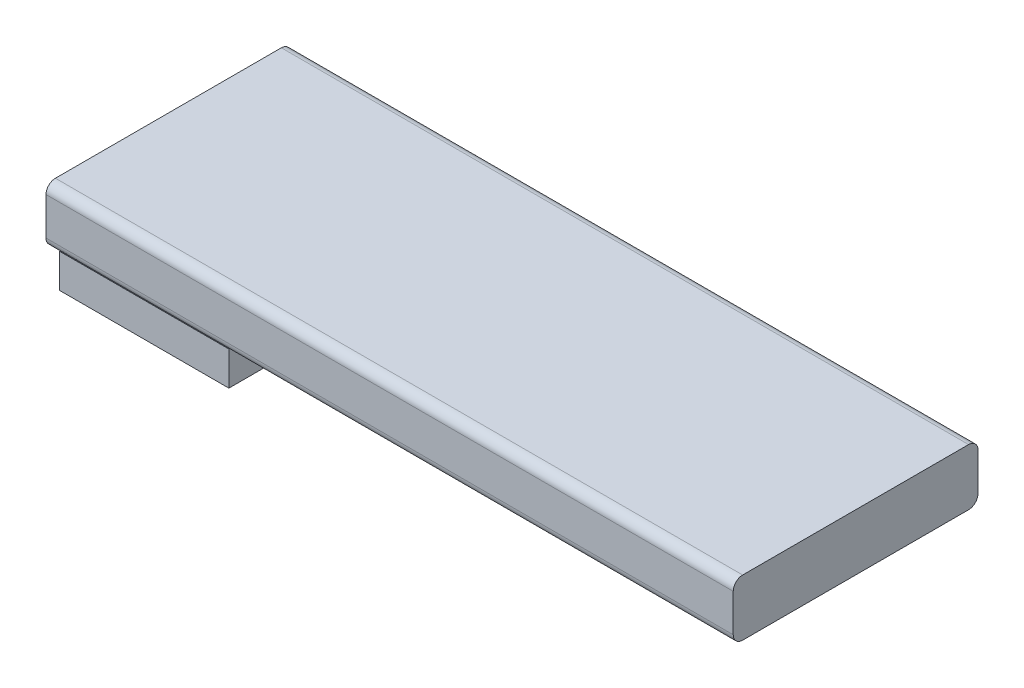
from build123d import *

# Parameters (mm, degrees)
SKETCH1_W           = 26
SKETCH1_H           = 6
BOSS_EXTRUDE1_DEPTH = 73
FILLET1_R           = 1
SKETCH2_W           = 18
SKETCH2_H           = 25
BOSS_EXTRUDE2_DEPTH = 3.6
SKETCH3_W           = 8.5
SKETCH3_H           = 5
BOSS_EXTRUDE3_DEPTH = 10


with BuildPart() as part:
    # Sketch1 → Boss-Extrude1 (new body)
    with BuildSketch(Plane(origin=(0, 0, 0), x_dir=(0, 0, -1), z_dir=(1, 0, 0))):
        Rectangle(SKETCH1_W, SKETCH1_H)
    extrude(amount=BOSS_EXTRUDE1_DEPTH)

    # Fillet1
    fillet1_edges = [part.edges().sort_by_distance(p)[0] for p in [
        (36.5, -3, -13),
        (36.5, -3, 13),
        (36.5, 3, 13),
        (36.5, 3, -13),
    ]]
    fillet(fillet1_edges, radius=FILLET1_R)

    # Sketch2 → Boss-Extrude2 (add)
    with BuildSketch(Plane.XZ.offset(3)):
        with Locations((9.927249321, 0)):
            Rectangle(SKETCH2_W, SKETCH2_H)
    extrude(amount=BOSS_EXTRUDE2_DEPTH)

    # Sketch3 → Boss-Extrude3 (add)
    with BuildSketch(Plane(origin=(0, 0, -12.5), x_dir=(-1, 0, 0), z_dir=(0, 0, -1))):
        with Locations((-9.677249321, -5.5)):
            Rectangle(SKETCH3_W, SKETCH3_H)
    extrude(amount=-BOSS_EXTRUDE3_DEPTH)


solid = part.part
